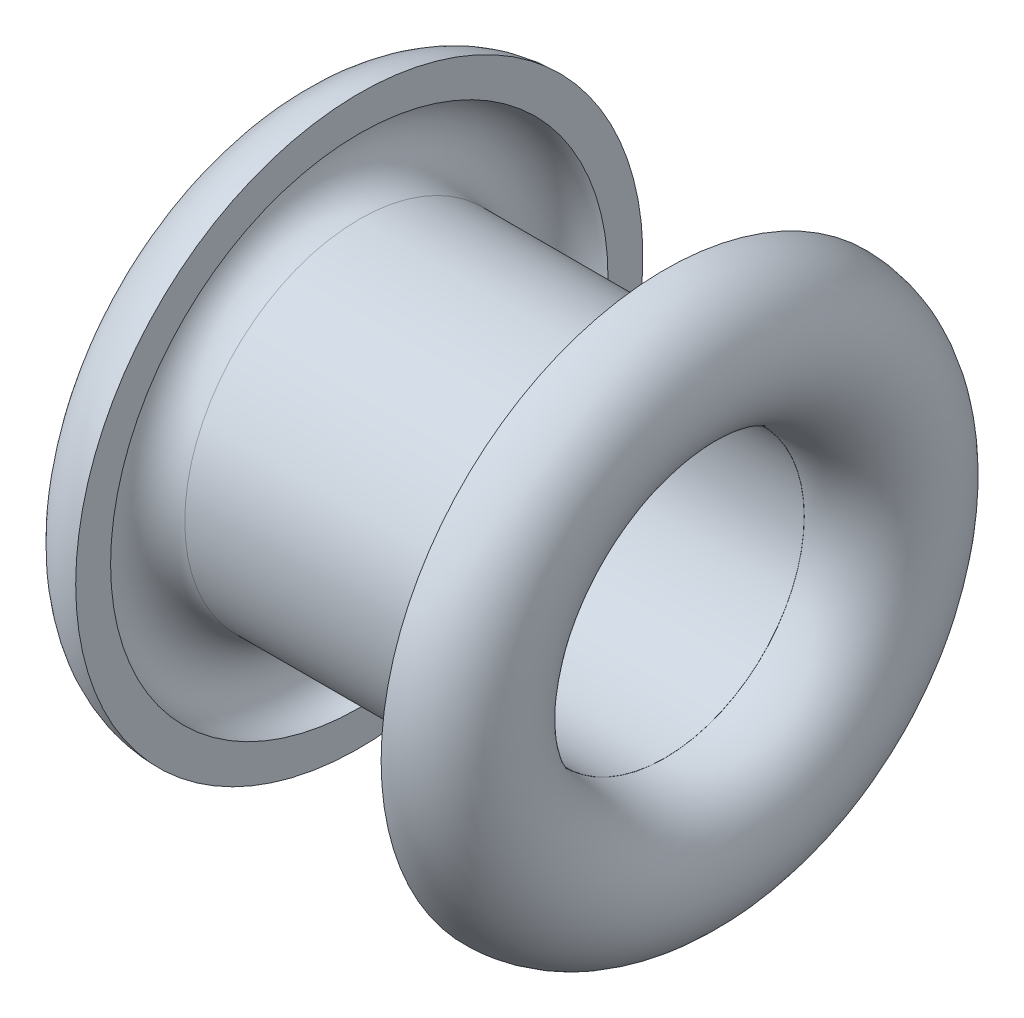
from build123d import *

# Parameters (mm, degrees)
ESQUISSE2_R      = 2
ESQUISSE2_R_2    = 1.598262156
EXTRUSION1_DEPTH = 1.75


with BuildPart() as part:
    # Esquisse1 → R_volution1 (revolve)
    with BuildSketch(Plane.XY, mode=Mode.PRIVATE) as r_volution1_sk:
        with BuildLine():
            Line((0, 2), (0, 1.6))
            ThreePointArc((0, 1.6), (-0.825, 2.425), (0, 3.25))
            Line((0, 3.25), (0, 2.85))
            ThreePointArc((0, 2.85), (-0.425, 2.425), (0, 2))
        make_face()
    revolve(r_volution1_sk.sketch.rotate(Axis((0, 0, 0), (1, 0, 0)), 90), axis=Axis((0, 0, 0), (1, 0, 0)))

    # Esquisse2 → Extrusion1 (add)
    with BuildSketch(Plane(origin=(0, 0, 0), x_dir=(0, 0, -1), z_dir=(1, 0, 0))):
        Circle(ESQUISSE2_R)
        Circle(ESQUISSE2_R_2, mode=Mode.SUBTRACT)
    extrude(amount=EXTRUSION1_DEPTH)

    # Sym_trie1: part across plane


with BuildPart() as part_1:
    add(part.part)
    add(part.part.mirror(Plane(origin=(1.75, 0, 0), x_dir=(0, 0, 1), z_dir=(1, 0, 0))))


solid = part_1.part
